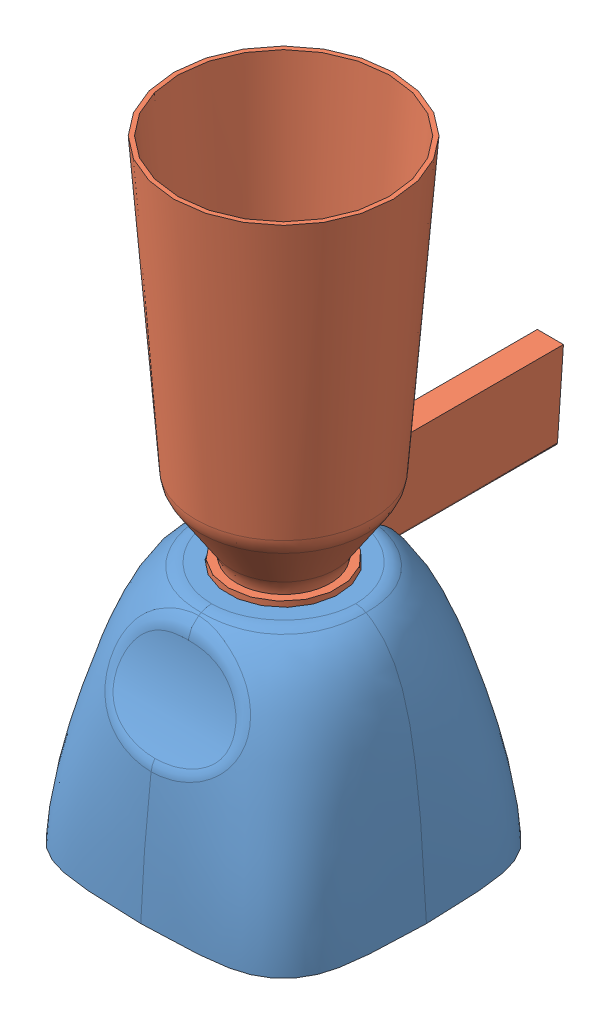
SolidWorks assembly Blender_Assembly_&.SLDASM, configuration Default (file format 13000). Lengths in mm.
Overall size (181.54 353.19 244.94).
2 component instances, 2 part files, 0 mates.
Components (placement in the parent):
- Blender_Base_&-1: Blender_Base_&.sldprt [Default] at origin size (181.54 141.75 181.54)
- Blender_Cup_&-1: Blender_Cup_&.sldprt [Default] at origin size (127 228.6 217.67)
